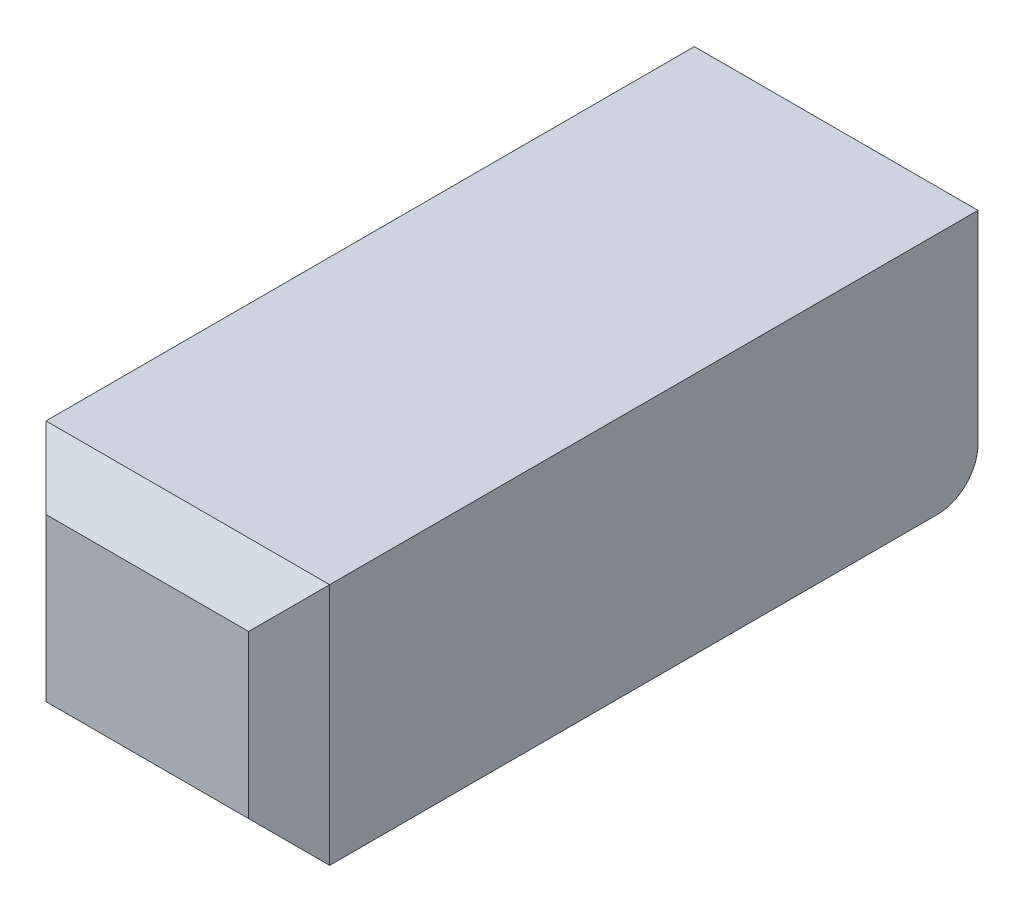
ISO-10303-21;
HEADER;
FILE_DESCRIPTION(('STEP AP214'),'2;1');
FILE_NAME('part.step','',(''),(''),'','','');
FILE_SCHEMA(('AUTOMOTIVE_DESIGN { 1 0 10303 214 1 1 1 1 }'));
ENDSEC;
DATA;
#1=APPLICATION_CONTEXT('core data for automotive mechanical design processes');
#2=APPLICATION_PROTOCOL_DEFINITION('international standard','automotive_design',2000,#1);
#3=PRODUCT_CONTEXT('',#1,'mechanical');
#4=PRODUCT('Part','Part','',(#3));
#5=PRODUCT_RELATED_PRODUCT_CATEGORY('part','',(#4));
#6=PRODUCT_DEFINITION_FORMATION('','',#4);
#7=PRODUCT_DEFINITION_CONTEXT('part definition',#1,'design');
#8=PRODUCT_DEFINITION('design','',#6,#7);
#9=PRODUCT_DEFINITION_SHAPE('','',#8);
#10=(LENGTH_UNIT() NAMED_UNIT(*) SI_UNIT(.MILLI.,.METRE.));
#11=(NAMED_UNIT(*) PLANE_ANGLE_UNIT() SI_UNIT($,.RADIAN.));
#12=(NAMED_UNIT(*) SI_UNIT($,.STERADIAN.) SOLID_ANGLE_UNIT());
#13=UNCERTAINTY_MEASURE_WITH_UNIT(LENGTH_MEASURE(1.E-05),#10,'distance_accuracy_value','');
#14=(GEOMETRIC_REPRESENTATION_CONTEXT(3) GLOBAL_UNCERTAINTY_ASSIGNED_CONTEXT((#13)) GLOBAL_UNIT_ASSIGNED_CONTEXT((#10,
#11,#12)) REPRESENTATION_CONTEXT('',''));
#15=CARTESIAN_POINT('',(0.,0.,0.));
#16=DIRECTION('',(0.,0.,1.));
#17=DIRECTION('',(1.,0.,0.));
#18=AXIS2_PLACEMENT_3D('',#15,#16,#17);
#19=CARTESIAN_POINT('',(-0.35,0.6,-0.85));
#20=DIRECTION('',(1.,0.,0.));
#21=DIRECTION('',(0.,0.,-1.));
#22=AXIS2_PLACEMENT_3D('',#19,#20,#21);
#23=PLANE('',#22);
#24=DIRECTION('',(0.,-1.,0.));
#25=VECTOR('',#24,1.);
#26=CARTESIAN_POINT('',(-0.35,0.6,-0.85));
#27=LINE('',#26,#25);
#28=CARTESIAN_POINT('',(-0.35,0.6,-0.85));
#29=VERTEX_POINT('',#28);
#30=CARTESIAN_POINT('',(-0.35,0.1,-0.85));
#31=VERTEX_POINT('',#30);
#32=EDGE_CURVE('E111',#29,#31,#27,.T.);
#33=ORIENTED_EDGE('',*,*,#32,.T.);
#34=CARTESIAN_POINT('',(-0.35,0.1,-0.75));
#35=DIRECTION('',(1.,0.,0.));
#36=DIRECTION('',(0.,0.,-1.));
#37=AXIS2_PLACEMENT_3D('',#34,#35,#36);
#38=CIRCLE('',#37,0.1);
#39=CARTESIAN_POINT('',(-0.35,0.,-0.75));
#40=VERTEX_POINT('',#39);
#41=EDGE_CURVE('E55',#31,#40,#38,.F.);
#42=ORIENTED_EDGE('',*,*,#41,.T.);
#43=DIRECTION('',(0.,0.,1.));
#44=VECTOR('',#43,1.);
#45=CARTESIAN_POINT('',(-0.35,0.,-0.85));
#46=LINE('',#45,#44);
#47=CARTESIAN_POINT('',(-0.35,0.,0.75));
#48=VERTEX_POINT('',#47);
#49=EDGE_CURVE('E119',#40,#48,#46,.T.);
#50=ORIENTED_EDGE('',*,*,#49,.T.);
#51=DIRECTION('',(0.,1.,0.));
#52=VECTOR('',#51,1.);
#53=CARTESIAN_POINT('',(-0.35,0.6,0.75));
#54=LINE('',#53,#52);
#55=CARTESIAN_POINT('',(-0.35,0.6,0.75));
#56=VERTEX_POINT('',#55);
#57=EDGE_CURVE('E132',#48,#56,#54,.T.);
#58=ORIENTED_EDGE('',*,*,#57,.T.);
#59=DIRECTION('',(0.,0.,1.));
#60=VECTOR('',#59,1.);
#61=CARTESIAN_POINT('',(-0.35,0.6,-0.85));
#62=LINE('',#61,#60);
#63=EDGE_CURVE('E101',#29,#56,#62,.T.);
#64=ORIENTED_EDGE('',*,*,#63,.F.);
#65=EDGE_LOOP('',(#33,#42,#50,#58,#64));
#66=FACE_BOUND('',#65,.T.);
#67=ADVANCED_FACE('F33',(#66),#23,.F.);
#68=CARTESIAN_POINT('',(-0.35,0.6,0.85));
#69=DIRECTION('',(0.,0.,-1.));
#70=DIRECTION('',(-1.,0.,0.));
#71=AXIS2_PLACEMENT_3D('',#68,#69,#70);
#72=PLANE('',#71);
#73=DIRECTION('',(-1.,0.,0.));
#74=VECTOR('',#73,1.);
#75=CARTESIAN_POINT('',(-0.35,0.499999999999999,0.85));
#76=LINE('',#75,#74);
#77=CARTESIAN_POINT('',(0.249999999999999,0.499999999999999,0.85));
#78=VERTEX_POINT('',#77);
#79=CARTESIAN_POINT('',(-0.249999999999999,0.499999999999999,0.85));
#80=VERTEX_POINT('',#79);
#81=EDGE_CURVE('E110',#78,#80,#76,.T.);
#82=ORIENTED_EDGE('',*,*,#81,.T.);
#83=DIRECTION('',(0.,-1.,0.));
#84=VECTOR('',#83,1.);
#85=CARTESIAN_POINT('',(-0.249999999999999,0.6,0.85));
#86=LINE('',#85,#84);
#87=CARTESIAN_POINT('',(-0.249999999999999,0.1,0.85));
#88=VERTEX_POINT('',#87);
#89=EDGE_CURVE('E129',#80,#88,#86,.T.);
#90=ORIENTED_EDGE('',*,*,#89,.T.);
#91=DIRECTION('',(1.,0.,0.));
#92=VECTOR('',#91,1.);
#93=CARTESIAN_POINT('',(-0.35,0.1,0.85));
#94=LINE('',#93,#92);
#95=CARTESIAN_POINT('',(0.249999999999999,0.1,0.85));
#96=VERTEX_POINT('',#95);
#97=EDGE_CURVE('E127',#88,#96,#94,.T.);
#98=ORIENTED_EDGE('',*,*,#97,.T.);
#99=DIRECTION('',(0.,1.,0.));
#100=VECTOR('',#99,1.);
#101=CARTESIAN_POINT('',(0.249999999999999,0.6,0.85));
#102=LINE('',#101,#100);
#103=EDGE_CURVE('E125',#96,#78,#102,.T.);
#104=ORIENTED_EDGE('',*,*,#103,.T.);
#105=EDGE_LOOP('',(#82,#90,#98,#104));
#106=FACE_BOUND('',#105,.T.);
#107=ADVANCED_FACE('F166',(#106),#72,.F.);
#108=CARTESIAN_POINT('',(0.35,0.6,-0.85));
#109=DIRECTION('',(-1.,0.,0.));
#110=DIRECTION('',(0.,0.,1.));
#111=AXIS2_PLACEMENT_3D('',#108,#109,#110);
#112=PLANE('',#111);
#113=DIRECTION('',(0.,0.,-1.));
#114=VECTOR('',#113,1.);
#115=CARTESIAN_POINT('',(0.35,0.,-0.85));
#116=LINE('',#115,#114);
#117=CARTESIAN_POINT('',(0.35,0.,0.75));
#118=VERTEX_POINT('',#117);
#119=CARTESIAN_POINT('',(0.35,0.,-0.75));
#120=VERTEX_POINT('',#119);
#121=EDGE_CURVE('E121',#118,#120,#116,.T.);
#122=ORIENTED_EDGE('',*,*,#121,.T.);
#123=CARTESIAN_POINT('',(0.35,0.1,-0.75));
#124=DIRECTION('',(-1.,0.,0.));
#125=DIRECTION('',(0.,0.,1.));
#126=AXIS2_PLACEMENT_3D('',#123,#124,#125);
#127=CIRCLE('',#126,0.1);
#128=CARTESIAN_POINT('',(0.35,0.1,-0.85));
#129=VERTEX_POINT('',#128);
#130=EDGE_CURVE('E11',#120,#129,#127,.F.);
#131=ORIENTED_EDGE('',*,*,#130,.T.);
#132=DIRECTION('',(0.,-1.,0.));
#133=VECTOR('',#132,1.);
#134=CARTESIAN_POINT('',(0.35,0.6,-0.85));
#135=LINE('',#134,#133);
#136=CARTESIAN_POINT('',(0.35,0.6,-0.85));
#137=VERTEX_POINT('',#136);
#138=EDGE_CURVE('E104',#137,#129,#135,.T.);
#139=ORIENTED_EDGE('',*,*,#138,.F.);
#140=DIRECTION('',(0.,0.,-1.));
#141=VECTOR('',#140,1.);
#142=CARTESIAN_POINT('',(0.35,0.6,-0.85));
#143=LINE('',#142,#141);
#144=CARTESIAN_POINT('',(0.35,0.6,0.75));
#145=VERTEX_POINT('',#144);
#146=EDGE_CURVE('E90',#145,#137,#143,.T.);
#147=ORIENTED_EDGE('',*,*,#146,.F.);
#148=DIRECTION('',(0.,-1.,0.));
#149=VECTOR('',#148,1.);
#150=CARTESIAN_POINT('',(0.35,0.6,0.75));
#151=LINE('',#150,#149);
#152=EDGE_CURVE('E138',#145,#118,#151,.T.);
#153=ORIENTED_EDGE('',*,*,#152,.T.);
#154=EDGE_LOOP('',(#122,#131,#139,#147,#153));
#155=FACE_BOUND('',#154,.T.);
#156=ADVANCED_FACE('F105',(#155),#112,.F.);
#157=CARTESIAN_POINT('',(-0.35,0.6,-0.85));
#158=DIRECTION('',(0.,0.,1.));
#159=DIRECTION('',(1.,0.,0.));
#160=AXIS2_PLACEMENT_3D('',#157,#158,#159);
#161=PLANE('',#160);
#162=ORIENTED_EDGE('',*,*,#138,.T.);
#163=DIRECTION('',(-1.,0.,0.));
#164=VECTOR('',#163,1.);
#165=CARTESIAN_POINT('',(-0.35,0.1,-0.85));
#166=LINE('',#165,#164);
#167=EDGE_CURVE('E141',#129,#31,#166,.T.);
#168=ORIENTED_EDGE('',*,*,#167,.T.);
#169=ORIENTED_EDGE('',*,*,#32,.F.);
#170=DIRECTION('',(-1.,0.,0.));
#171=VECTOR('',#170,1.);
#172=CARTESIAN_POINT('',(-0.35,0.6,-0.85));
#173=LINE('',#172,#171);
#174=EDGE_CURVE('E95',#137,#29,#173,.T.);
#175=ORIENTED_EDGE('',*,*,#174,.F.);
#176=EDGE_LOOP('',(#162,#168,#169,#175));
#177=FACE_BOUND('',#176,.T.);
#178=ADVANCED_FACE('F113',(#177),#161,.F.);
#179=CARTESIAN_POINT('',(0.,0.6,0.));
#180=DIRECTION('',(0.,1.,0.));
#181=DIRECTION('',(0.,0.,1.));
#182=AXIS2_PLACEMENT_3D('',#179,#180,#181);
#183=PLANE('',#182);
#184=ORIENTED_EDGE('',*,*,#63,.T.);
#185=DIRECTION('',(1.,0.,0.));
#186=VECTOR('',#185,1.);
#187=CARTESIAN_POINT('',(0.35,0.6,0.75));
#188=LINE('',#187,#186);
#189=EDGE_CURVE('E98',#56,#145,#188,.T.);
#190=ORIENTED_EDGE('',*,*,#189,.T.);
#191=ORIENTED_EDGE('',*,*,#146,.T.);
#192=ORIENTED_EDGE('',*,*,#174,.T.);
#193=EDGE_LOOP('',(#184,#190,#191,#192));
#194=FACE_BOUND('',#193,.T.);
#195=ADVANCED_FACE('F93',(#194),#183,.T.);
#196=CARTESIAN_POINT('',(0.,0.,0.));
#197=DIRECTION('',(0.,1.,0.));
#198=DIRECTION('',(0.,0.,1.));
#199=AXIS2_PLACEMENT_3D('',#196,#197,#198);
#200=PLANE('',#199);
#201=ORIENTED_EDGE('',*,*,#49,.F.);
#202=DIRECTION('',(-1.,0.,0.));
#203=VECTOR('',#202,1.);
#204=CARTESIAN_POINT('',(0.,0.,-0.75));
#205=LINE('',#204,#203);
#206=EDGE_CURVE('E41',#40,#120,#205,.F.);
#207=ORIENTED_EDGE('',*,*,#206,.T.);
#208=ORIENTED_EDGE('',*,*,#121,.F.);
#209=DIRECTION('',(-1.,0.,0.));
#210=VECTOR('',#209,1.);
#211=CARTESIAN_POINT('',(0.,0.,0.75));
#212=LINE('',#211,#210);
#213=EDGE_CURVE('E135',#118,#48,#212,.T.);
#214=ORIENTED_EDGE('',*,*,#213,.T.);
#215=EDGE_LOOP('',(#201,#207,#208,#214));
#216=FACE_BOUND('',#215,.T.);
#217=ADVANCED_FACE('F173',(#216),#200,.F.);
#218=CARTESIAN_POINT('',(0.35,0.6,0.75));
#219=DIRECTION('',(-0.707106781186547,0.,-0.707106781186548));
#220=DIRECTION('',(0.,-1.,0.));
#221=AXIS2_PLACEMENT_3D('',#218,#219,#220);
#222=PLANE('',#221);
#223=DIRECTION('',(0.577350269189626,-0.577350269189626,-0.577350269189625));
#224=VECTOR('',#223,1.);
#225=CARTESIAN_POINT('',(0.15,0.2,0.95));
#226=LINE('',#225,#224);
#227=EDGE_CURVE('E146',#118,#96,#226,.F.);
#228=ORIENTED_EDGE('',*,*,#227,.F.);
#229=ORIENTED_EDGE('',*,*,#152,.F.);
#230=DIRECTION('',(-0.577350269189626,-0.577350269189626,0.577350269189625));
#231=VECTOR('',#230,1.);
#232=CARTESIAN_POINT('',(0.233333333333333,0.483333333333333,0.866666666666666));
#233=LINE('',#232,#231);
#234=EDGE_CURVE('E122',#78,#145,#233,.F.);
#235=ORIENTED_EDGE('',*,*,#234,.F.);
#236=ORIENTED_EDGE('',*,*,#103,.F.);
#237=EDGE_LOOP('',(#228,#229,#235,#236));
#238=FACE_BOUND('',#237,.T.);
#239=ADVANCED_FACE('F172',(#238),#222,.F.);
#240=CARTESIAN_POINT('',(0.,0.6,0.75));
#241=DIRECTION('',(0.,0.707106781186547,0.707106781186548));
#242=DIRECTION('',(-1.,0.,0.));
#243=AXIS2_PLACEMENT_3D('',#240,#241,#242);
#244=PLANE('',#243);
#245=ORIENTED_EDGE('',*,*,#234,.T.);
#246=ORIENTED_EDGE('',*,*,#189,.F.);
#247=DIRECTION('',(-0.577350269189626,0.577350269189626,-0.577350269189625));
#248=VECTOR('',#247,1.);
#249=CARTESIAN_POINT('',(-0.233333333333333,0.483333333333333,0.866666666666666));
#250=LINE('',#249,#248);
#251=EDGE_CURVE('E144',#80,#56,#250,.T.);
#252=ORIENTED_EDGE('',*,*,#251,.F.);
#253=ORIENTED_EDGE('',*,*,#81,.F.);
#254=EDGE_LOOP('',(#245,#246,#252,#253));
#255=FACE_BOUND('',#254,.T.);
#256=ADVANCED_FACE('F170',(#255),#244,.T.);
#257=CARTESIAN_POINT('',(-0.35,0.1,0.85));
#258=DIRECTION('',(0.,0.707106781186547,-0.707106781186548));
#259=DIRECTION('',(1.,0.,0.));
#260=AXIS2_PLACEMENT_3D('',#257,#258,#259);
#261=PLANE('',#260);
#262=ORIENTED_EDGE('',*,*,#227,.T.);
#263=ORIENTED_EDGE('',*,*,#97,.F.);
#264=DIRECTION('',(-0.577350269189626,-0.577350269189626,-0.577350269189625));
#265=VECTOR('',#264,1.);
#266=CARTESIAN_POINT('',(-0.283333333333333,0.0666666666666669,0.816666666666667));
#267=LINE('',#266,#265);
#268=EDGE_CURVE('E142',#48,#88,#267,.F.);
#269=ORIENTED_EDGE('',*,*,#268,.F.);
#270=ORIENTED_EDGE('',*,*,#213,.F.);
#271=EDGE_LOOP('',(#262,#263,#269,#270));
#272=FACE_BOUND('',#271,.T.);
#273=ADVANCED_FACE('F162',(#272),#261,.F.);
#274=CARTESIAN_POINT('',(-0.249999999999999,0.6,0.85));
#275=DIRECTION('',(0.707106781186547,0.,-0.707106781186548));
#276=DIRECTION('',(0.,-1.,0.));
#277=AXIS2_PLACEMENT_3D('',#274,#275,#276);
#278=PLANE('',#277);
#279=ORIENTED_EDGE('',*,*,#251,.T.);
#280=ORIENTED_EDGE('',*,*,#57,.F.);
#281=ORIENTED_EDGE('',*,*,#268,.T.);
#282=ORIENTED_EDGE('',*,*,#89,.F.);
#283=EDGE_LOOP('',(#279,#280,#281,#282));
#284=FACE_BOUND('',#283,.T.);
#285=ADVANCED_FACE('F156',(#284),#278,.F.);
#286=CARTESIAN_POINT('',(-0.35,0.1,-0.75));
#287=DIRECTION('',(-1.,0.,0.));
#288=DIRECTION('',(0.,0.,1.));
#289=AXIS2_PLACEMENT_3D('',#286,#287,#288);
#290=CYLINDRICAL_SURFACE('',#289,0.1);
#291=ORIENTED_EDGE('',*,*,#130,.F.);
#292=ORIENTED_EDGE('',*,*,#206,.F.);
#293=ORIENTED_EDGE('',*,*,#41,.F.);
#294=ORIENTED_EDGE('',*,*,#167,.F.);
#295=EDGE_LOOP('',(#291,#292,#293,#294));
#296=FACE_BOUND('',#295,.T.);
#297=ADVANCED_FACE('F35',(#296),#290,.T.);
#298=CLOSED_SHELL('',(#67,#107,#156,#178,#195,#217,#239,#256,#273,#285,#297));
#299=MANIFOLD_SOLID_BREP('B2',#298);
#300=ADVANCED_BREP_SHAPE_REPRESENTATION('',(#18,#299),#14);
#301=SHAPE_DEFINITION_REPRESENTATION(#9,#300);
ENDSEC;
END-ISO-10303-21;
